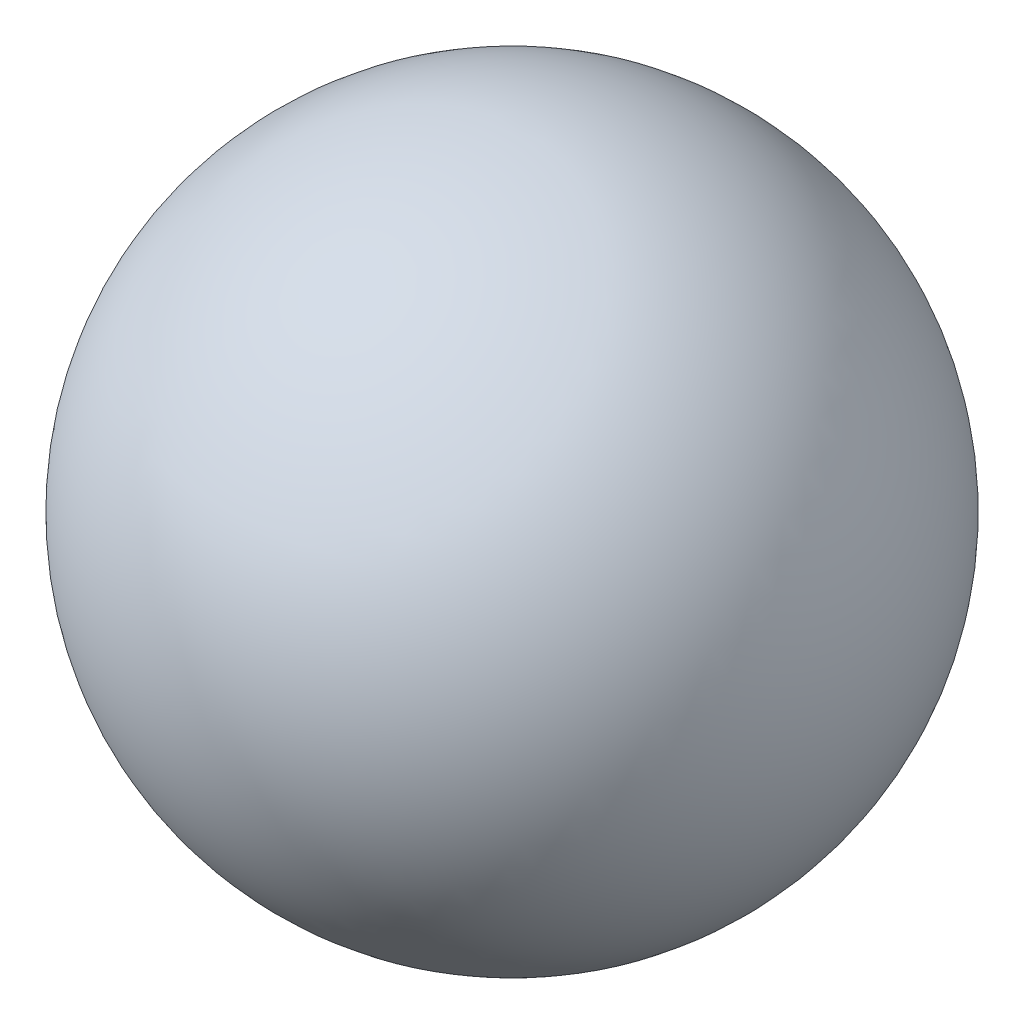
from build123d import *


with BuildPart() as part:
    # Skica1 → Oto_it kolem osy1 (revolve)
    with BuildSketch(Plane.XY):
        with BuildLine():
            Line((0, 86.25), (0, -86.25))
            ThreePointArc((0, -86.25), (-86.25, 0), (0, 86.25))
        make_face()
    revolve(axis=Axis((0, 86.25, 0), (0, -1, 0)))


solid = part.part
